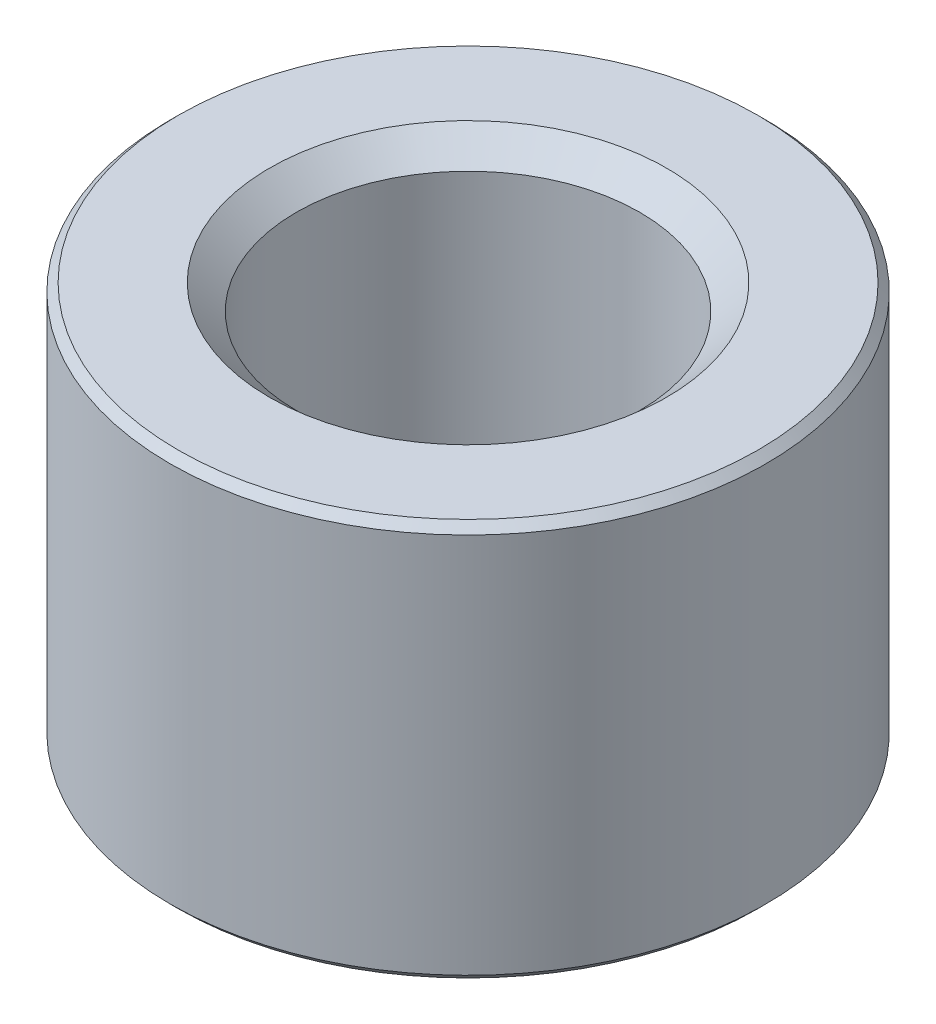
ISO-10303-21;
HEADER;
FILE_DESCRIPTION(('STEP AP214'),'2;1');
FILE_NAME('part.step','',(''),(''),'','','');
FILE_SCHEMA(('AUTOMOTIVE_DESIGN { 1 0 10303 214 1 1 1 1 }'));
ENDSEC;
DATA;
#1=APPLICATION_CONTEXT('core data for automotive mechanical design processes');
#2=APPLICATION_PROTOCOL_DEFINITION('international standard','automotive_design',2000,#1);
#3=PRODUCT_CONTEXT('',#1,'mechanical');
#4=PRODUCT('Part','Part','',(#3));
#5=PRODUCT_RELATED_PRODUCT_CATEGORY('part','',(#4));
#6=PRODUCT_DEFINITION_FORMATION('','',#4);
#7=PRODUCT_DEFINITION_CONTEXT('part definition',#1,'design');
#8=PRODUCT_DEFINITION('design','',#6,#7);
#9=PRODUCT_DEFINITION_SHAPE('','',#8);
#10=(LENGTH_UNIT() NAMED_UNIT(*) SI_UNIT(.MILLI.,.METRE.));
#11=(NAMED_UNIT(*) PLANE_ANGLE_UNIT() SI_UNIT($,.RADIAN.));
#12=(NAMED_UNIT(*) SI_UNIT($,.STERADIAN.) SOLID_ANGLE_UNIT());
#13=UNCERTAINTY_MEASURE_WITH_UNIT(LENGTH_MEASURE(1.E-05),#10,'distance_accuracy_value','');
#14=(GEOMETRIC_REPRESENTATION_CONTEXT(3) GLOBAL_UNCERTAINTY_ASSIGNED_CONTEXT((#13)) GLOBAL_UNIT_ASSIGNED_CONTEXT((#10,
#11,#12)) REPRESENTATION_CONTEXT('',''));
#15=CARTESIAN_POINT('',(0.,0.,0.));
#16=DIRECTION('',(0.,0.,1.));
#17=DIRECTION('',(1.,0.,0.));
#18=AXIS2_PLACEMENT_3D('',#15,#16,#17);
#19=CARTESIAN_POINT('',(8.75999999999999,0.,0.));
#20=DIRECTION('',(0.,-1.,0.));
#21=DIRECTION('',(0.,0.,-1.));
#22=AXIS2_PLACEMENT_3D('',#19,#20,#21);
#23=PLANE('',#22);
#24=CARTESIAN_POINT('',(0.,0.,0.));
#25=DIRECTION('',(0.,1.,0.));
#26=DIRECTION('',(0.,0.,1.));
#27=AXIS2_PLACEMENT_3D('',#24,#25,#26);
#28=CIRCLE('',#27,6.);
#29=CARTESIAN_POINT('',(0.,0.,6.));
#30=VERTEX_POINT('',#29);
#31=EDGE_CURVE('E10',#30,#30,#28,.T.);
#32=ORIENTED_EDGE('',*,*,#31,.T.);
#33=EDGE_LOOP('',(#32));
#34=FACE_BOUND('',#33,.T.);
#35=CARTESIAN_POINT('',(0.,0.,0.));
#36=DIRECTION('',(0.,1.,0.));
#37=DIRECTION('',(0.,0.,1.));
#38=AXIS2_PLACEMENT_3D('',#35,#36,#37);
#39=CIRCLE('',#38,8.76);
#40=CARTESIAN_POINT('',(0.,0.,8.76));
#41=VERTEX_POINT('',#40);
#42=EDGE_CURVE('E52',#41,#41,#39,.T.);
#43=ORIENTED_EDGE('',*,*,#42,.F.);
#44=EDGE_LOOP('',(#43));
#45=FACE_BOUND('',#44,.T.);
#46=ADVANCED_FACE('F24',(#34,#45),#23,.T.);
#47=CARTESIAN_POINT('',(0.,0.,0.));
#48=DIRECTION('',(0.,-1.,0.));
#49=DIRECTION('',(0.,0.,-1.));
#50=AXIS2_PLACEMENT_3D('',#47,#48,#49);
#51=CONICAL_SURFACE('',#50,6.,0.824993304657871);
#52=CARTESIAN_POINT('',(0.,0.749999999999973,0.));
#53=DIRECTION('',(0.,1.,0.));
#54=DIRECTION('',(0.,0.,1.));
#55=AXIS2_PLACEMENT_3D('',#52,#53,#54);
#56=CIRCLE('',#55,5.188125);
#57=CARTESIAN_POINT('',(0.,0.749999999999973,5.188125));
#58=VERTEX_POINT('',#57);
#59=EDGE_CURVE('E30',#58,#58,#56,.T.);
#60=ORIENTED_EDGE('',*,*,#59,.T.);
#61=EDGE_LOOP('',(#60));
#62=FACE_BOUND('',#61,.T.);
#63=ORIENTED_EDGE('',*,*,#31,.F.);
#64=EDGE_LOOP('',(#63));
#65=FACE_BOUND('',#64,.T.);
#66=ADVANCED_FACE('F60',(#62,#65),#51,.F.);
#67=CARTESIAN_POINT('',(0.,0.,0.));
#68=DIRECTION('',(0.,1.,0.));
#69=DIRECTION('',(0.,0.,1.));
#70=AXIS2_PLACEMENT_3D('',#67,#68,#69);
#71=CYLINDRICAL_SURFACE('',#70,5.188125);
#72=CARTESIAN_POINT('',(0.,11.25,0.));
#73=DIRECTION('',(0.,1.,0.));
#74=DIRECTION('',(0.,0.,1.));
#75=AXIS2_PLACEMENT_3D('',#72,#73,#74);
#76=CIRCLE('',#75,5.188125);
#77=CARTESIAN_POINT('',(0.,11.25,5.188125));
#78=VERTEX_POINT('',#77);
#79=EDGE_CURVE('E34',#78,#78,#76,.T.);
#80=ORIENTED_EDGE('',*,*,#79,.T.);
#81=EDGE_LOOP('',(#80));
#82=FACE_BOUND('',#81,.T.);
#83=ORIENTED_EDGE('',*,*,#59,.F.);
#84=EDGE_LOOP('',(#83));
#85=FACE_BOUND('',#84,.T.);
#86=ADVANCED_FACE('F64',(#82,#85),#71,.F.);
#87=CARTESIAN_POINT('',(0.,11.25,0.));
#88=DIRECTION('',(0.,1.,0.));
#89=DIRECTION('',(0.,0.,1.));
#90=AXIS2_PLACEMENT_3D('',#87,#88,#89);
#91=CONICAL_SURFACE('',#90,5.188125,0.824993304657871);
#92=CARTESIAN_POINT('',(0.,12.,0.));
#93=DIRECTION('',(0.,1.,0.));
#94=DIRECTION('',(0.,0.,1.));
#95=AXIS2_PLACEMENT_3D('',#92,#93,#94);
#96=CIRCLE('',#95,6.);
#97=CARTESIAN_POINT('',(0.,12.,6.));
#98=VERTEX_POINT('',#97);
#99=EDGE_CURVE('E38',#98,#98,#96,.T.);
#100=ORIENTED_EDGE('',*,*,#99,.T.);
#101=EDGE_LOOP('',(#100));
#102=FACE_BOUND('',#101,.T.);
#103=ORIENTED_EDGE('',*,*,#79,.F.);
#104=EDGE_LOOP('',(#103));
#105=FACE_BOUND('',#104,.T.);
#106=ADVANCED_FACE('F68',(#102,#105),#91,.F.);
#107=CARTESIAN_POINT('',(5.99999999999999,12.,0.));
#108=DIRECTION('',(0.,1.,0.));
#109=DIRECTION('',(0.,0.,1.));
#110=AXIS2_PLACEMENT_3D('',#107,#108,#109);
#111=PLANE('',#110);
#112=CARTESIAN_POINT('',(0.,12.,0.));
#113=DIRECTION('',(0.,1.,0.));
#114=DIRECTION('',(0.,0.,1.));
#115=AXIS2_PLACEMENT_3D('',#112,#113,#114);
#116=CIRCLE('',#115,8.76);
#117=CARTESIAN_POINT('',(0.,12.,8.76));
#118=VERTEX_POINT('',#117);
#119=EDGE_CURVE('E43',#118,#118,#116,.T.);
#120=ORIENTED_EDGE('',*,*,#119,.T.);
#121=EDGE_LOOP('',(#120));
#122=FACE_BOUND('',#121,.T.);
#123=ORIENTED_EDGE('',*,*,#99,.F.);
#124=EDGE_LOOP('',(#123));
#125=FACE_BOUND('',#124,.T.);
#126=ADVANCED_FACE('F75',(#122,#125),#111,.T.);
#127=CARTESIAN_POINT('',(0.,12.,0.));
#128=DIRECTION('',(0.,-1.,0.));
#129=DIRECTION('',(0.,0.,-1.));
#130=AXIS2_PLACEMENT_3D('',#127,#128,#129);
#131=CONICAL_SURFACE('',#130,8.76,0.785398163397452);
#132=CARTESIAN_POINT('',(0.,11.76,0.));
#133=DIRECTION('',(0.,1.,0.));
#134=DIRECTION('',(0.,0.,1.));
#135=AXIS2_PLACEMENT_3D('',#132,#133,#134);
#136=CIRCLE('',#135,9.);
#137=CARTESIAN_POINT('',(0.,11.76,9.));
#138=VERTEX_POINT('',#137);
#139=EDGE_CURVE('E46',#138,#138,#136,.T.);
#140=ORIENTED_EDGE('',*,*,#139,.T.);
#141=EDGE_LOOP('',(#140));
#142=FACE_BOUND('',#141,.T.);
#143=ORIENTED_EDGE('',*,*,#119,.F.);
#144=EDGE_LOOP('',(#143));
#145=FACE_BOUND('',#144,.T.);
#146=ADVANCED_FACE('F79',(#142,#145),#131,.T.);
#147=CARTESIAN_POINT('',(0.,0.,0.));
#148=DIRECTION('',(0.,1.,0.));
#149=DIRECTION('',(0.,0.,1.));
#150=AXIS2_PLACEMENT_3D('',#147,#148,#149);
#151=CYLINDRICAL_SURFACE('',#150,9.);
#152=CARTESIAN_POINT('',(0.,0.239999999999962,0.));
#153=DIRECTION('',(0.,1.,0.));
#154=DIRECTION('',(0.,0.,1.));
#155=AXIS2_PLACEMENT_3D('',#152,#153,#154);
#156=CIRCLE('',#155,9.);
#157=CARTESIAN_POINT('',(0.,0.239999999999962,9.));
#158=VERTEX_POINT('',#157);
#159=EDGE_CURVE('E49',#158,#158,#156,.T.);
#160=ORIENTED_EDGE('',*,*,#159,.T.);
#161=EDGE_LOOP('',(#160));
#162=FACE_BOUND('',#161,.T.);
#163=ORIENTED_EDGE('',*,*,#139,.F.);
#164=EDGE_LOOP('',(#163));
#165=FACE_BOUND('',#164,.T.);
#166=ADVANCED_FACE('F83',(#162,#165),#151,.T.);
#167=CARTESIAN_POINT('',(0.,0.239999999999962,0.));
#168=DIRECTION('',(0.,1.,0.));
#169=DIRECTION('',(0.,0.,1.));
#170=AXIS2_PLACEMENT_3D('',#167,#168,#169);
#171=CONICAL_SURFACE('',#170,9.,0.785398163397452);
#172=ORIENTED_EDGE('',*,*,#42,.T.);
#173=EDGE_LOOP('',(#172));
#174=FACE_BOUND('',#173,.T.);
#175=ORIENTED_EDGE('',*,*,#159,.F.);
#176=EDGE_LOOP('',(#175));
#177=FACE_BOUND('',#176,.T.);
#178=ADVANCED_FACE('F56',(#174,#177),#171,.T.);
#179=CLOSED_SHELL('',(#46,#66,#86,#106,#126,#146,#166,#178));
#180=MANIFOLD_SOLID_BREP('B2',#179);
#181=ADVANCED_BREP_SHAPE_REPRESENTATION('',(#18,#180),#14);
#182=SHAPE_DEFINITION_REPRESENTATION(#9,#181);
ENDSEC;
END-ISO-10303-21;
